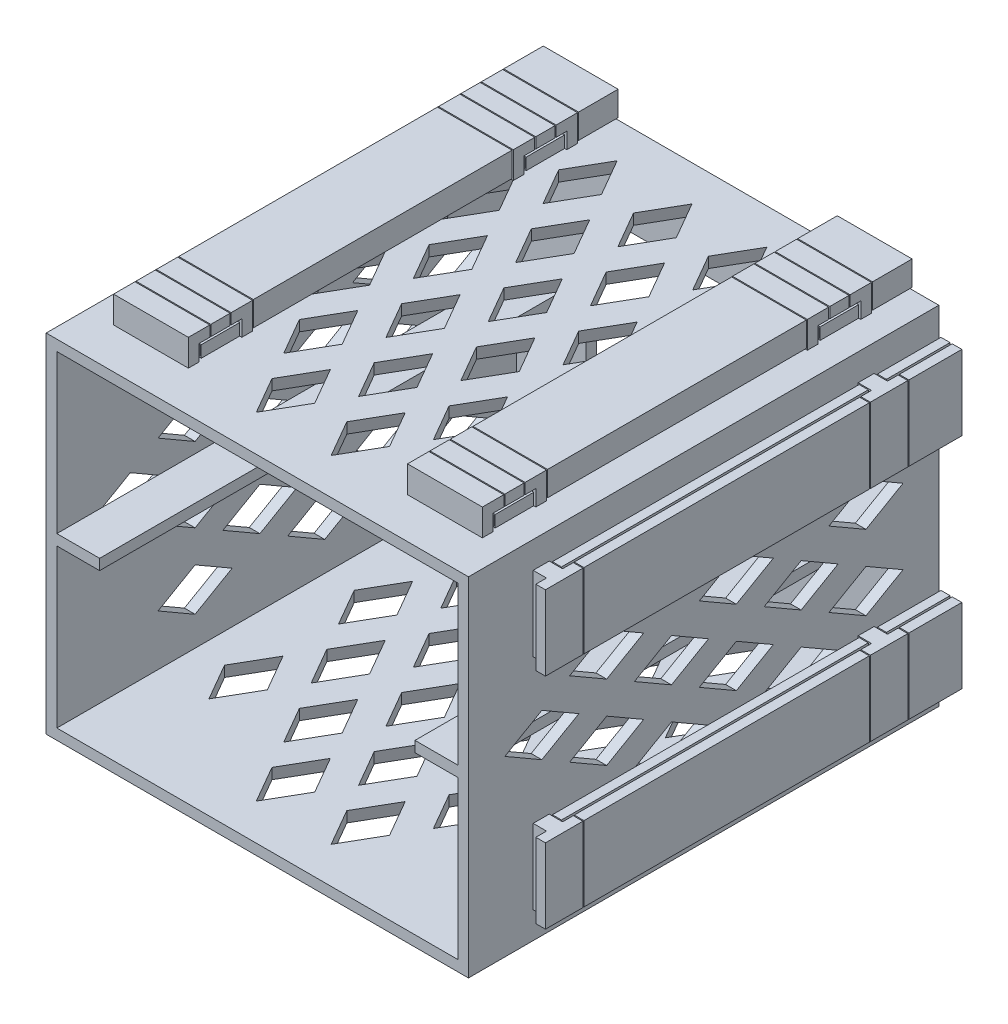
from build123d import *

# Parameters (mm, degrees)
CROQUIS1_W          = 79
CROQUIS1_H          = 65
CROQUIS1_W_2        = 49
CROQUIS1_H_2        = 35
FONDO_DEPTH         = 2
CROQUIS3_W          = 79
CROQUIS3_H          = 65
CROQUIS3_W_2        = 75
CROQUIS3_H_2        = 61
ESTRUCTURA_DEPTH    = 86
ROMBOSHOR_REACH     = 124.643
ROMBOSVERT_DEPTH    = 65
CROQUIS8_W          = 8
CROQUIS8_H          = 2
GUIAS_DEPTH         = 86
CROQUIS10_W         = 3
CROQUIS10_H         = 14
ANCDER01_DEPTH      = 2.5
CROQUIS11_W         = 7
CROQUIS11_H         = 14
ANCDER02_DEPTH      = 1.8
CROQUIS12_W         = 14
CROQUIS12_H         = 2
ANCSUP01_DEPTH      = 3
CROQUIS13_W         = 14
CROQUIS13_H         = 4
ANCSUP02_DEPTH      = 2
CROQUIS61_W         = 14
CROQUIS61_H         = 4.6
CROQUIS61_W_2       = 13.6
CROQUIS61_H_2       = 4.2
ESPANCSUP01_DEPTH   = 7.404
ESPANCSUP01_2_DEPTH = 7.404
CROQUIS57_W         = 13.954269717
CROQUIS57_H         = 4.6
CROQUIS57_W_2       = 13.554269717
CROQUIS57_H_2       = 4.2
ESPANCSUP02_DEPTH   = 48.392
ESPANCSUP02_2_DEPTH = 48.392
CROQUIS58_W         = 12.554269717
CROQUIS58_H         = 3.2
CROQUIS58_W_2       = 12.154269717
CROQUIS58_H_2       = 2.8
ESPANCSUP03_DEPTH   = 48.392
ESPANCSUP03_2_DEPTH = 48.392
CROQUIS59_W         = 11.154269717
CROQUIS59_H         = 1.8
CROQUIS59_W_2       = 10.754269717
CROQUIS59_H_2       = 1.4
ESPANCSUP04_DEPTH   = 48.392
ESPANCSUP04_2_DEPTH = 48.392
CROQUIS64_W         = 14
CROQUIS64_H         = 7.2
ESPANCSUP05_DEPTH   = 2.2
ESPANCSUP05_2_DEPTH = 2.2
ESPANCSUP05_3_DEPTH = 2.2
ESPANCSUP05_4_DEPTH = 2.2
CROQUIS66_W         = 13.6
CROQUIS66_H         = 1.8
ESPANCSUP06_DEPTH   = 7.2
CROQUIS68_W         = 13.6
CROQUIS68_H         = 1.8
ESPANCSUP07_DEPTH   = 7.2
CROQUIS70_W         = 14
CROQUIS70_H         = 3.6
ESPANCSUP08_DEPTH   = 2
ESPANCSUP08_2_DEPTH = 2
ESPANCSUP08_3_DEPTH = 2
ESPANCSUP08_4_DEPTH = 2
CROQUIS71_W         = 13.6
CROQUIS71_H         = 1.6
ESPANCSUP09_DEPTH   = 3.6
CROQUIS72_W         = 13.6
CROQUIS72_H         = 1.6
ESPANCSUP10_DEPTH   = 3.6
CROQUIS93_W         = 1.7
CROQUIS93_H         = 14
CROQUIS93_W_2       = 1.3
CROQUIS93_H_2       = 13.6
ESPANCDER01_DEPTH   = 11.904
ESPANCDER01_2_DEPTH = 11.904
CROQUIS94_W         = 1.8
CROQUIS94_H         = 14
CROQUIS94_W_2       = 1.4
CROQUIS94_H_2       = 13.6
ESPANCDER02_DEPTH   = 9.904
ESPANCDER02_2_DEPTH = 9.904
CROQUIS95_W         = 1.7
CROQUIS95_H         = 14
CROQUIS95_W_2       = 1.3
CROQUIS95_H_2       = 13.6
ESPANCDER03_DEPTH   = 57.392
ESPANCDER03_2_DEPTH = 57.392
CROQUIS96_W         = 0.5
CROQUIS96_H         = 12.8
ESPANCDER04_DEPTH   = 57.392
ESPANCDER04_2_DEPTH = 57.392
CROQUIS97_W         = 1.8
CROQUIS97_H         = 14
CROQUIS97_W_2       = 1.4
CROQUIS97_H_2       = 13.6
ESPANCDER05_DEPTH   = 53.392
ESPANCDER05_2_DEPTH = 53.392
CROQUIS98_W         = 0.6
CROQUIS98_H         = 12.8
ESPANCDER06_DEPTH   = 53.392
ESPANCDER06_2_DEPTH = 53.392


with BuildPart() as part:
    # Croquis1 → Fondo (new body)
    with BuildSketch(Plane(origin=(0, 0, 0), x_dir=(-1, 0, 0), z_dir=(0, 0, -1))):
        Rectangle(CROQUIS1_W, CROQUIS1_H)
        Rectangle(CROQUIS1_W_2, CROQUIS1_H_2, mode=Mode.SUBTRACT)
    extrude(amount=-FONDO_DEPTH)

    # Croquis3 → Estructura (add)
    with BuildSketch(Plane.XY.offset(2)):
        Rectangle(CROQUIS3_W, CROQUIS3_H)
        Rectangle(CROQUIS3_W_2, CROQUIS3_H_2, mode=Mode.SUBTRACT)
    extrude(amount=ESTRUCTURA_DEPTH)

    # RombosHor: up to this face of the body (flat: up to its plane)
    romboshor_end = Plane(part.part.faces().sort_by_distance((39.5, 0, 44))[0])
    # Croquis5 → RombosHor (cut, up to the picked face)
    with BuildSketch(Plane.ZY.offset(39.5), mode=Mode.PRIVATE) as romboshor_sk1:
        Polygon((13.628, 25), (20.556, 21), (13.628, 17), (6.7, 21), align=None)
    romboshor_tool1 = split(extrude(romboshor_sk1.sketch, amount=-ROMBOSHOR_REACH, mode=Mode.PRIVATE), bisect_by=romboshor_end, keep=Keep.BOTH, mode=Mode.PRIVATE)
    # Croquis5 → RombosHor (cut, up to the picked face)
    with BuildSketch(Plane.ZY.offset(39.5), mode=Mode.PRIVATE) as romboshor_sk2:
        Polygon((13.628, 11), (20.556, 7), (13.628, 3), (6.7, 7), align=None)
    romboshor_tool2 = split(extrude(romboshor_sk2.sketch, amount=-ROMBOSHOR_REACH, mode=Mode.PRIVATE), bisect_by=romboshor_end, keep=Keep.BOTH, mode=Mode.PRIVATE)
    # Croquis5 → RombosHor (cut, up to the picked face)
    with BuildSketch(Plane.ZY.offset(39.5), mode=Mode.PRIVATE) as romboshor_sk3:
        Polygon((13.628, -3), (20.556, -7), (13.628, -11), (6.7, -7), align=None)
    romboshor_tool3 = split(extrude(romboshor_sk3.sketch, amount=-ROMBOSHOR_REACH, mode=Mode.PRIVATE), bisect_by=romboshor_end, keep=Keep.BOTH, mode=Mode.PRIVATE)
    # Croquis5 → RombosHor (cut, up to the picked face)
    with BuildSketch(Plane.ZY.offset(39.5), mode=Mode.PRIVATE) as romboshor_sk4:
        Polygon((13.628, -17), (20.556, -21), (13.628, -25), (6.7, -21), align=None)
    romboshor_tool4 = split(extrude(romboshor_sk4.sketch, amount=-ROMBOSHOR_REACH, mode=Mode.PRIVATE), bisect_by=romboshor_end, keep=Keep.BOTH, mode=Mode.PRIVATE)
    # Croquis5 → RombosHor (cut, up to the picked face)
    with BuildSketch(Plane.ZY.offset(39.5), mode=Mode.PRIVATE) as romboshor_sk5:
        Polygon((37.884, 25), (44.812, 21), (37.884, 17), (30.956, 21), align=None)
    romboshor_tool5 = split(extrude(romboshor_sk5.sketch, amount=-ROMBOSHOR_REACH, mode=Mode.PRIVATE), bisect_by=romboshor_end, keep=Keep.BOTH, mode=Mode.PRIVATE)
    # Croquis5 → RombosHor (cut, up to the picked face)
    with BuildSketch(Plane.ZY.offset(39.5), mode=Mode.PRIVATE) as romboshor_sk6:
        Polygon((44.812, 7), (37.884, 3), (30.956, 7), (37.884, 11), align=None)
    romboshor_tool6 = split(extrude(romboshor_sk6.sketch, amount=-ROMBOSHOR_REACH, mode=Mode.PRIVATE), bisect_by=romboshor_end, keep=Keep.BOTH, mode=Mode.PRIVATE)
    # Croquis5 → RombosHor (cut, up to the picked face)
    with BuildSketch(Plane.ZY.offset(39.5), mode=Mode.PRIVATE) as romboshor_sk7:
        Polygon((44.812, -7), (37.884, -11), (30.956, -7), (37.884, -3), align=None)
    romboshor_tool7 = split(extrude(romboshor_sk7.sketch, amount=-ROMBOSHOR_REACH, mode=Mode.PRIVATE), bisect_by=romboshor_end, keep=Keep.BOTH, mode=Mode.PRIVATE)
    # Croquis5 → RombosHor (cut, up to the picked face)
    with BuildSketch(Plane.ZY.offset(39.5), mode=Mode.PRIVATE) as romboshor_sk8:
        Polygon((37.884, -17), (44.812, -21), (37.884, -25), (30.956, -21), align=None)
    romboshor_tool8 = split(extrude(romboshor_sk8.sketch, amount=-ROMBOSHOR_REACH, mode=Mode.PRIVATE), bisect_by=romboshor_end, keep=Keep.BOTH, mode=Mode.PRIVATE)
    # Croquis5 → RombosHor (cut, up to the picked face)
    with BuildSketch(Plane.ZY.offset(39.5), mode=Mode.PRIVATE) as romboshor_sk9:
        Polygon((62.14, 25), (69.068, 21), (62.14, 17), (55.212, 21), align=None)
    romboshor_tool9 = split(extrude(romboshor_sk9.sketch, amount=-ROMBOSHOR_REACH, mode=Mode.PRIVATE), bisect_by=romboshor_end, keep=Keep.BOTH, mode=Mode.PRIVATE)
    # Croquis5 → RombosHor (cut, up to the picked face)
    with BuildSketch(Plane.ZY.offset(39.5), mode=Mode.PRIVATE) as romboshor_sk10:
        Polygon((69.068, 7), (62.14, 3), (55.212, 7), (62.14, 11), align=None)
    romboshor_tool10 = split(extrude(romboshor_sk10.sketch, amount=-ROMBOSHOR_REACH, mode=Mode.PRIVATE), bisect_by=romboshor_end, keep=Keep.BOTH, mode=Mode.PRIVATE)
    # Croquis5 → RombosHor (cut, up to the picked face)
    with BuildSketch(Plane.ZY.offset(39.5), mode=Mode.PRIVATE) as romboshor_sk11:
        Polygon((69.068, -7), (62.14, -11), (55.212, -7), (62.14, -3), align=None)
    romboshor_tool11 = split(extrude(romboshor_sk11.sketch, amount=-ROMBOSHOR_REACH, mode=Mode.PRIVATE), bisect_by=romboshor_end, keep=Keep.BOTH, mode=Mode.PRIVATE)
    # Croquis5 → RombosHor (cut, up to the picked face)
    with BuildSketch(Plane.ZY.offset(39.5), mode=Mode.PRIVATE) as romboshor_sk12:
        Polygon((62.14, -17), (69.068, -21), (62.14, -25), (55.212, -21), align=None)
    romboshor_tool12 = split(extrude(romboshor_sk12.sketch, amount=-ROMBOSHOR_REACH, mode=Mode.PRIVATE), bisect_by=romboshor_end, keep=Keep.BOTH, mode=Mode.PRIVATE)
    # Croquis5 → RombosHor (cut, up to the picked face)
    with BuildSketch(Plane.ZY.offset(39.5), mode=Mode.PRIVATE) as romboshor_sk13:
        Polygon((50.012, 18), (56.94, 14), (50.012, 10), (43.084, 14), align=None)
    romboshor_tool13 = split(extrude(romboshor_sk13.sketch, amount=-ROMBOSHOR_REACH, mode=Mode.PRIVATE), bisect_by=romboshor_end, keep=Keep.BOTH, mode=Mode.PRIVATE)
    # Croquis5 → RombosHor (cut, up to the picked face)
    with BuildSketch(Plane.ZY.offset(39.5), mode=Mode.PRIVATE) as romboshor_sk14:
        Polygon((50.012, 4), (56.94, 0), (50.012, -4), (43.084, 0), align=None)
    romboshor_tool14 = split(extrude(romboshor_sk14.sketch, amount=-ROMBOSHOR_REACH, mode=Mode.PRIVATE), bisect_by=romboshor_end, keep=Keep.BOTH, mode=Mode.PRIVATE)
    # Croquis5 → RombosHor (cut, up to the picked face)
    with BuildSketch(Plane.ZY.offset(39.5), mode=Mode.PRIVATE) as romboshor_sk15:
        Polygon((56.94, -14), (50.012, -18), (43.084, -14), (50.012, -10), align=None)
    romboshor_tool15 = split(extrude(romboshor_sk15.sketch, amount=-ROMBOSHOR_REACH, mode=Mode.PRIVATE), bisect_by=romboshor_end, keep=Keep.BOTH, mode=Mode.PRIVATE)
    # Croquis5 → RombosHor (cut, up to the picked face)
    with BuildSketch(Plane.ZY.offset(39.5), mode=Mode.PRIVATE) as romboshor_sk16:
        Polygon((18.828, 14), (25.756, 18), (32.684, 14), (25.756, 10), align=None)
    romboshor_tool16 = split(extrude(romboshor_sk16.sketch, amount=-ROMBOSHOR_REACH, mode=Mode.PRIVATE), bisect_by=romboshor_end, keep=Keep.BOTH, mode=Mode.PRIVATE)
    # Croquis5 → RombosHor (cut, up to the picked face)
    with BuildSketch(Plane.ZY.offset(39.5), mode=Mode.PRIVATE) as romboshor_sk17:
        Polygon((25.756, 4), (32.684, 0), (25.756, -4), (18.828, 0), align=None)
    romboshor_tool17 = split(extrude(romboshor_sk17.sketch, amount=-ROMBOSHOR_REACH, mode=Mode.PRIVATE), bisect_by=romboshor_end, keep=Keep.BOTH, mode=Mode.PRIVATE)
    # Croquis5 → RombosHor (cut, up to the picked face)
    with BuildSketch(Plane.ZY.offset(39.5), mode=Mode.PRIVATE) as romboshor_sk18:
        Polygon((25.756, -18), (18.828, -14), (25.756, -10), (32.684, -14), align=None)
    romboshor_tool18 = split(extrude(romboshor_sk18.sketch, amount=-ROMBOSHOR_REACH, mode=Mode.PRIVATE), bisect_by=romboshor_end, keep=Keep.BOTH, mode=Mode.PRIVATE)
    # Croquis5 → RombosHor (cut, up to the picked face)
    with BuildSketch(Plane.ZY.offset(39.5), mode=Mode.PRIVATE) as romboshor_sk19:
        Polygon((81.196, 0), (74.268, -4), (67.34, 0), (74.268, 4), align=None)
    romboshor_tool19 = split(extrude(romboshor_sk19.sketch, amount=-ROMBOSHOR_REACH, mode=Mode.PRIVATE), bisect_by=romboshor_end, keep=Keep.BOTH, mode=Mode.PRIVATE)
    add(romboshor_tool1.solids().sort_by(Axis((-39.5, 21, 13.628), (1, 0, 0)))[0], mode=Mode.SUBTRACT)
    add(romboshor_tool2.solids().sort_by(Axis((-39.5, 7, 13.628), (1, 0, 0)))[0], mode=Mode.SUBTRACT)
    add(romboshor_tool3.solids().sort_by(Axis((-39.5, -7, 13.628), (1, 0, 0)))[0], mode=Mode.SUBTRACT)
    add(romboshor_tool4.solids().sort_by(Axis((-39.5, -21, 13.628), (1, 0, 0)))[0], mode=Mode.SUBTRACT)
    add(romboshor_tool5.solids().sort_by(Axis((-39.5, 21, 37.884), (1, 0, 0)))[0], mode=Mode.SUBTRACT)
    add(romboshor_tool6.solids().sort_by(Axis((-39.5, 7, 37.884), (1, 0, 0)))[0], mode=Mode.SUBTRACT)
    add(romboshor_tool7.solids().sort_by(Axis((-39.5, -7, 37.884), (1, 0, 0)))[0], mode=Mode.SUBTRACT)
    add(romboshor_tool8.solids().sort_by(Axis((-39.5, -21, 37.884), (1, 0, 0)))[0], mode=Mode.SUBTRACT)
    add(romboshor_tool9.solids().sort_by(Axis((-39.5, 21, 62.14), (1, 0, 0)))[0], mode=Mode.SUBTRACT)
    add(romboshor_tool10.solids().sort_by(Axis((-39.5, 7, 62.14), (1, 0, 0)))[0], mode=Mode.SUBTRACT)
    add(romboshor_tool11.solids().sort_by(Axis((-39.5, -7, 62.14), (1, 0, 0)))[0], mode=Mode.SUBTRACT)
    add(romboshor_tool12.solids().sort_by(Axis((-39.5, -21, 62.14), (1, 0, 0)))[0], mode=Mode.SUBTRACT)
    add(romboshor_tool13.solids().sort_by(Axis((-39.5, 14, 50.012), (1, 0, 0)))[0], mode=Mode.SUBTRACT)
    add(romboshor_tool14.solids().sort_by(Axis((-39.5, 0, 50.012), (1, 0, 0)))[0], mode=Mode.SUBTRACT)
    add(romboshor_tool15.solids().sort_by(Axis((-39.5, -14, 50.012), (1, 0, 0)))[0], mode=Mode.SUBTRACT)
    add(romboshor_tool16.solids().sort_by(Axis((-39.5, 14, 25.756), (1, 0, 0)))[0], mode=Mode.SUBTRACT)
    add(romboshor_tool17.solids().sort_by(Axis((-39.5, 0, 25.756), (1, 0, 0)))[0], mode=Mode.SUBTRACT)
    add(romboshor_tool18.solids().sort_by(Axis((-39.5, -14, 25.756), (1, 0, 0)))[0], mode=Mode.SUBTRACT)
    add(romboshor_tool19.solids().sort_by(Axis((-39.5, 0, 74.268), (1, 0, 0)))[0], mode=Mode.SUBTRACT)

    # Croquis9 → RombosVert (cut)
    with BuildSketch(Plane(origin=(0, 32.5, 0), x_dir=(1, 0, 0), z_dir=(0, 1, 0))):
        Polygon((28, -6.68718177), (24, -13.615385), (28, -20.543588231), (32, -13.615385), align=None)
        Polygon((14, -6.68718177), (10, -13.615385), (14, -20.543588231), (18, -13.615385), align=None)
        Polygon((0, -6.68718177), (-4, -13.615385), (0, -20.543588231), (4, -13.615385), align=None)
        Polygon((-14, -6.68718177), (-18, -13.615385), (-14, -20.543588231), (-10, -13.615385), align=None)
        Polygon((-28, -6.68718177), (-32, -13.615385), (-28, -20.543588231), (-24, -13.615385), align=None)
        Polygon((14, -30.94359177), (10, -37.871795), (14, -44.799998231), (18, -37.871795), align=None)
        Polygon((0, -30.94359177), (-4, -37.871795), (0, -44.799998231), (4, -37.871795), align=None)
        Polygon((-14, -30.94359177), (-18, -37.871795), (-14, -44.799998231), (-10, -37.871795), align=None)
        Polygon((-28, -30.94359177), (-32, -37.871795), (-28, -44.799998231), (-24, -37.871795), align=None)
        Polygon((14, -55.20000177), (10, -62.128205), (14, -69.056408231), (18, -62.128205), align=None)
        Polygon((0, -55.20000177), (-4, -62.128205), (0, -69.056408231), (4, -62.128205), align=None)
        Polygon((-14, -55.20000177), (-18, -62.128205), (-14, -69.056408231), (-10, -62.128205), align=None)
        Polygon((-28, -55.20000177), (-32, -62.128205), (-28, -69.056408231), (-24, -62.128205), align=None)
        Polygon((28, -30.94359177), (24, -37.871795), (28, -44.799998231), (32, -37.871795), align=None)
        Polygon((28, -55.20000177), (24, -62.128205), (28, -69.056408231), (32, -62.128205), align=None)
        Polygon((17, -50.001795), (21, -56.929998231), (25, -50.001795), (21, -43.07359177), align=None)
        Polygon((7, -67.33000177), (11, -74.258205), (7, -81.186408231), (3, -74.258205), align=None)
        Polygon((-7, -67.33000177), (-11, -74.258205), (-7, -81.186408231), (-3, -74.258205), align=None)
        Polygon((7, -18.81718177), (3, -25.745385), (7, -32.673588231), (11, -25.745385), align=None)
        Polygon((17, -25.745385), (21, -32.673588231), (25, -25.745385), (21, -18.81718177), align=None)
        Polygon((-7, -43.07359177), (-11, -50.001795), (-7, -56.929998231), (-3, -50.001795), align=None)
        Polygon((-21, -43.07359177), (-25, -50.001795), (-21, -56.929998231), (-17, -50.001795), align=None)
        Polygon((-3, -25.745385), (-7, -32.673588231), (-11, -25.745385), (-7, -18.81718177), align=None)
        Polygon((-21, -18.81718177), (-17, -25.745385), (-21, -32.673588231), (-25, -25.745385), align=None)
        Polygon((7, -43.07359177), (3, -50.001795), (7, -56.929998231), (11, -50.001795), align=None)
    extrude(amount=-ROMBOSVERT_DEPTH, mode=Mode.SUBTRACT)

    # Croquis8 → Guias (add)
    with BuildSketch(Plane.XY.offset(2)):
        with Locations((-33.5, 0)):
            Rectangle(CROQUIS8_W, CROQUIS8_H)
        with Locations((33.5, 0)):
            Rectangle(CROQUIS8_W, CROQUIS8_H)
    extrude(amount=GUIAS_DEPTH)

    # Croquis10 → AncDer01 (add)
    with BuildSketch(Plane(origin=(39.5, 0, 0), x_dir=(0, 0, -1), z_dir=(1, 0, 0))):
        with Locations((-13.604, -20.5)):
            Rectangle(CROQUIS10_W, CROQUIS10_H)
        with Locations((-74.396, 20.5)):
            Rectangle(CROQUIS10_W, CROQUIS10_H)
        with Locations((-13.604, 20.5)):
            Rectangle(CROQUIS10_W, CROQUIS10_H)
        with Locations((-74.396, -20.5)):
            Rectangle(CROQUIS10_W, CROQUIS10_H)
    extrude(amount=ANCDER01_DEPTH)

    # Croquis11 → AncDer02 (add)
    with BuildSketch(Plane(origin=(42, 0, 0), x_dir=(0, 0, -1), z_dir=(1, 0, 0))):
        with Locations((-13.604, 20.5)):
            Rectangle(CROQUIS11_W, CROQUIS11_H)
        with Locations((-13.604, -20.5)):
            Rectangle(CROQUIS11_W, CROQUIS11_H)
        with Locations((-74.396, -20.5)):
            Rectangle(CROQUIS11_W, CROQUIS11_H)
        with Locations((-74.396, 20.5)):
            Rectangle(CROQUIS11_W, CROQUIS11_H)
    extrude(amount=ANCDER02_DEPTH)

    # Croquis12 → AncSup01 (add)
    with BuildSketch(Plane(origin=(0, 32.5, 0), x_dir=(1, 0, 0), z_dir=(0, 1, 0))):
        with Locations((27.5, -8.604)):
            Rectangle(CROQUIS12_W, CROQUIS12_H)
        with Locations((27.5, -18.604)):
            Rectangle(CROQUIS12_W, CROQUIS12_H)
        with Locations((-27.5, -79.396)):
            Rectangle(CROQUIS12_W, CROQUIS12_H)
        with Locations((-27.5, -69.396)):
            Rectangle(CROQUIS12_W, CROQUIS12_H)
        with Locations((27.5, -69.396)):
            Rectangle(CROQUIS12_W, CROQUIS12_H)
        with Locations((-27.5, -18.604)):
            Rectangle(CROQUIS12_W, CROQUIS12_H)
        with Locations((-27.5, -8.604)):
            Rectangle(CROQUIS12_W, CROQUIS12_H)
        with Locations((27.5, -79.396)):
            Rectangle(CROQUIS12_W, CROQUIS12_H)
    extrude(amount=ANCSUP01_DEPTH)

    # Croquis13 → AncSup02 (add)
    with BuildSketch(Plane(origin=(0, 35.5, 0), x_dir=(1, 0, 0), z_dir=(0, 1, 0))):
        with Locations((-27.5, -9.604)):
            Rectangle(CROQUIS13_W, CROQUIS13_H)
        with Locations((-27.5, -17.604)):
            Rectangle(CROQUIS13_W, CROQUIS13_H)
        with Locations((27.5, -17.604)):
            Rectangle(CROQUIS13_W, CROQUIS13_H)
        with Locations((27.5, -9.604)):
            Rectangle(CROQUIS13_W, CROQUIS13_H)
        with Locations((27.5, -78.396)):
            Rectangle(CROQUIS13_W, CROQUIS13_H)
        with Locations((27.5, -70.396)):
            Rectangle(CROQUIS13_W, CROQUIS13_H)
        with Locations((-27.5, -70.396)):
            Rectangle(CROQUIS13_W, CROQUIS13_H)
        with Locations((-27.5, -78.396)):
            Rectangle(CROQUIS13_W, CROQUIS13_H)
    extrude(amount=ANCSUP02_DEPTH)


with BuildPart() as body_2:
    # Croquis61 → EspAncSup01 (new body)
    with BuildSketch(Plane(origin=(0, 0, 0), x_dir=(-1, 0, 0), z_dir=(0, 0, -1))):
        with Locations((27.5, 35.2)):
            Rectangle(CROQUIS61_W, CROQUIS61_H)
        with Locations((27.5, 35.2)):
            Rectangle(CROQUIS61_W_2, CROQUIS61_H_2, mode=Mode.SUBTRACT)
    extrude(amount=-ESPANCSUP01_DEPTH)


with BuildPart() as body_3:
    # Croquis61 → EspAncSup01 2 (new body)
    with BuildSketch(Plane(origin=(0, 0, 0), x_dir=(-1, 0, 0), z_dir=(0, 0, -1))):
        with Locations((-27.5, 35.2)):
            Rectangle(CROQUIS61_W, CROQUIS61_H)
        with Locations((-27.5, 35.2)):
            Rectangle(CROQUIS61_W_2, CROQUIS61_H_2, mode=Mode.SUBTRACT)
    extrude(amount=-ESPANCSUP01_2_DEPTH)


with BuildPart() as body_4:
    # Croquis57 → EspAncSup02 (new body)
    with BuildSketch(Plane.XY.offset(19.804)):
        with Locations((27.522865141, 35.2)):
            Rectangle(CROQUIS57_W, CROQUIS57_H)
        with Locations((27.522865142, 35.2)):
            Rectangle(CROQUIS57_W_2, CROQUIS57_H_2, mode=Mode.SUBTRACT)
    extrude(amount=ESPANCSUP02_DEPTH)


with BuildPart() as body_5:
    # Croquis57 → EspAncSup02 2 (new body)
    with BuildSketch(Plane.XY.offset(19.804)):
        with Locations((-27.522865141, 35.2)):
            Rectangle(CROQUIS57_W, CROQUIS57_H)
        with Locations((-27.522865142, 35.2)):
            Rectangle(CROQUIS57_W_2, CROQUIS57_H_2, mode=Mode.SUBTRACT)
    extrude(amount=ESPANCSUP02_2_DEPTH)


with BuildPart() as body_6:
    # Croquis58 → EspAncSup03 (new body)
    with BuildSketch(Plane.XY.offset(19.804)):
        with Locations((27.522865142, 35.2)):
            Rectangle(CROQUIS58_W, CROQUIS58_H)
        with Locations((27.522865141, 35.2)):
            Rectangle(CROQUIS58_W_2, CROQUIS58_H_2, mode=Mode.SUBTRACT)
    extrude(amount=ESPANCSUP03_DEPTH)


with BuildPart() as body_7:
    # Croquis58 → EspAncSup03 2 (new body)
    with BuildSketch(Plane.XY.offset(19.804)):
        with Locations((-27.522865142, 35.2)):
            Rectangle(CROQUIS58_W, CROQUIS58_H)
        with Locations((-27.522865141, 35.2)):
            Rectangle(CROQUIS58_W_2, CROQUIS58_H_2, mode=Mode.SUBTRACT)
    extrude(amount=ESPANCSUP03_2_DEPTH)


with BuildPart() as body_8:
    # Croquis59 → EspAncSup04 (new body)
    with BuildSketch(Plane.XY.offset(19.804)):
        with Locations((27.522865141, 35.2)):
            Rectangle(CROQUIS59_W, CROQUIS59_H)
        with Locations((27.522865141, 35.2)):
            Rectangle(CROQUIS59_W_2, CROQUIS59_H_2, mode=Mode.SUBTRACT)
    extrude(amount=ESPANCSUP04_DEPTH)


with BuildPart() as body_9:
    # Croquis59 → EspAncSup04 2 (new body)
    with BuildSketch(Plane.XY.offset(19.804)):
        with Locations((-27.522865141, 35.2)):
            Rectangle(CROQUIS59_W, CROQUIS59_H)
        with Locations((-27.522865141, 35.2)):
            Rectangle(CROQUIS59_W_2, CROQUIS59_H_2, mode=Mode.SUBTRACT)
    extrude(amount=ESPANCSUP04_2_DEPTH)


with BuildPart() as body_10:
    # Croquis64 → EspAncSup05 (new body)
    with BuildSketch(Plane(origin=(0, 32.9, 0), x_dir=(1, 0, 0), z_dir=(0, 1, 0))):
        with Locations((-27.5, -13.604)):
            Rectangle(CROQUIS64_W, CROQUIS64_H)
    extrude(amount=ESPANCSUP05_DEPTH)


with BuildPart() as body_11:
    # Croquis64 → EspAncSup05 2 (new body)
    with BuildSketch(Plane(origin=(0, 32.9, 0), x_dir=(1, 0, 0), z_dir=(0, 1, 0))):
        with Locations((27.5, -13.604)):
            Rectangle(CROQUIS64_W, CROQUIS64_H)
    extrude(amount=ESPANCSUP05_2_DEPTH)


with BuildPart() as body_12:
    # Croquis64 → EspAncSup05 3 (new body)
    with BuildSketch(Plane(origin=(0, 32.9, 0), x_dir=(1, 0, 0), z_dir=(0, 1, 0))):
        with Locations((27.5, -74.396)):
            Rectangle(CROQUIS64_W, CROQUIS64_H)
    extrude(amount=ESPANCSUP05_3_DEPTH)


with BuildPart() as body_13:
    # Croquis64 → EspAncSup05 4 (new body)
    with BuildSketch(Plane(origin=(0, 32.9, 0), x_dir=(1, 0, 0), z_dir=(0, 1, 0))):
        with Locations((-27.5, -74.396)):
            Rectangle(CROQUIS64_W, CROQUIS64_H)
    extrude(amount=ESPANCSUP05_4_DEPTH)


with BuildPart() as espancsup06_tool:
    # Croquis66 → EspAncSup06 (new body)
    with BuildSketch(Plane.XY.offset(17.204)):
        with Locations((-27.5, 34)):
            Rectangle(CROQUIS66_W, CROQUIS66_H)
        with Locations((27.5, 34)):
            Rectangle(CROQUIS66_W, CROQUIS66_H)
    extrude(amount=-ESPANCSUP06_DEPTH)


with BuildPart() as body_10_1:
    add(body_10.part)

    # EspAncSup06: cut by espancsup06_tool
    add(espancsup06_tool.part, mode=Mode.SUBTRACT)


with BuildPart() as body_11_1:
    add(body_11.part)

    # EspAncSup06: cut by espancsup06_tool
    add(espancsup06_tool.part, mode=Mode.SUBTRACT)


with BuildPart() as espancsup07_tool:
    # Croquis68 → EspAncSup07 (new body)
    with BuildSketch(Plane.XY.offset(77.996)):
        with Locations((27.5, 34)):
            Rectangle(CROQUIS68_W, CROQUIS68_H)
        with Locations((-27.5, 34)):
            Rectangle(CROQUIS68_W, CROQUIS68_H)
    extrude(amount=-ESPANCSUP07_DEPTH)


with BuildPart() as body_12_1:
    add(body_12.part)

    # EspAncSup07: cut by espancsup07_tool
    add(espancsup07_tool.part, mode=Mode.SUBTRACT)


with BuildPart() as body_13_1:
    add(body_13.part)

    # EspAncSup07: cut by espancsup07_tool
    add(espancsup07_tool.part, mode=Mode.SUBTRACT)


with BuildPart() as body_14:
    # Croquis70 → EspAncSup08 (new body)
    with BuildSketch(Plane.XZ.offset(-35.5)):
        with Locations((-27.5, 74.396)):
            Rectangle(CROQUIS70_W, CROQUIS70_H)
    extrude(amount=-ESPANCSUP08_DEPTH)


with BuildPart() as body_15:
    # Croquis70 → EspAncSup08 2 (new body)
    with BuildSketch(Plane.XZ.offset(-35.5)):
        with Locations((27.5, 13.604)):
            Rectangle(CROQUIS70_W, CROQUIS70_H)
    extrude(amount=-ESPANCSUP08_2_DEPTH)


with BuildPart() as body_16:
    # Croquis70 → EspAncSup08 3 (new body)
    with BuildSketch(Plane.XZ.offset(-35.5)):
        with Locations((27.5, 74.396)):
            Rectangle(CROQUIS70_W, CROQUIS70_H)
    extrude(amount=-ESPANCSUP08_3_DEPTH)


with BuildPart() as body_17:
    # Croquis70 → EspAncSup08 4 (new body)
    with BuildSketch(Plane.XZ.offset(-35.5)):
        with Locations((-27.5, 13.604)):
            Rectangle(CROQUIS70_W, CROQUIS70_H)
    extrude(amount=-ESPANCSUP08_4_DEPTH)


with BuildPart() as espancsup09_tool:
    # Croquis71 → EspAncSup09 (new body)
    with BuildSketch(Plane(origin=(0, 0, 72.596), x_dir=(-1, 0, 0), z_dir=(0, 0, -1))):
        with Locations((-27.5, 36.5)):
            Rectangle(CROQUIS71_W, CROQUIS71_H)
        with Locations((27.5, 36.5)):
            Rectangle(CROQUIS71_W, CROQUIS71_H)
    extrude(amount=-ESPANCSUP09_DEPTH)


with BuildPart() as body_14_1:
    add(body_14.part)

    # EspAncSup09: cut by espancsup09_tool
    add(espancsup09_tool.part, mode=Mode.SUBTRACT)


with BuildPart() as body_16_1:
    add(body_16.part)

    # EspAncSup09: cut by espancsup09_tool
    add(espancsup09_tool.part, mode=Mode.SUBTRACT)


with BuildPart() as espancsup10_tool:
    # Croquis72 → EspAncSup10 (new body)
    with BuildSketch(Plane(origin=(0, 0, 11.804), x_dir=(-1, 0, 0), z_dir=(0, 0, -1))):
        with Locations((-27.5, 36.5)):
            Rectangle(CROQUIS72_W, CROQUIS72_H)
        with Locations((27.5, 36.5)):
            Rectangle(CROQUIS72_W, CROQUIS72_H)
    extrude(amount=-ESPANCSUP10_DEPTH)


with BuildPart() as body_15_1:
    add(body_15.part)

    # EspAncSup10: cut by espancsup10_tool
    add(espancsup10_tool.part, mode=Mode.SUBTRACT)


with BuildPart() as body_17_1:
    add(body_17.part)

    # EspAncSup10: cut by espancsup10_tool
    add(espancsup10_tool.part, mode=Mode.SUBTRACT)


with BuildPart() as body_18:
    # Croquis93 → EspAncDer01 (new body)
    with BuildSketch(Plane(origin=(0, 0, 0), x_dir=(-1, 0, 0), z_dir=(0, 0, -1))):
        with Locations((-40.75, -20.5)):
            Rectangle(CROQUIS93_W, CROQUIS93_H)
        with Locations((-40.75, -20.5)):
            Rectangle(CROQUIS93_W_2, CROQUIS93_H_2, mode=Mode.SUBTRACT)
    extrude(amount=-ESPANCDER01_DEPTH)


with BuildPart() as body_19:
    # Croquis93 → EspAncDer01 2 (new body)
    with BuildSketch(Plane(origin=(0, 0, 0), x_dir=(-1, 0, 0), z_dir=(0, 0, -1))):
        with Locations((-40.75, 20.5)):
            Rectangle(CROQUIS93_W, CROQUIS93_H)
        with Locations((-40.75, 20.5)):
            Rectangle(CROQUIS93_W_2, CROQUIS93_H_2, mode=Mode.SUBTRACT)
    extrude(amount=-ESPANCDER01_2_DEPTH)


with BuildPart() as body_20:
    # Croquis94 → EspAncDer02 (new body)
    with BuildSketch(Plane(origin=(0, 0, 0), x_dir=(-1, 0, 0), z_dir=(0, 0, -1))):
        with Locations((-42.9, -20.5)):
            Rectangle(CROQUIS94_W, CROQUIS94_H)
        with Locations((-42.9, -20.5)):
            Rectangle(CROQUIS94_W_2, CROQUIS94_H_2, mode=Mode.SUBTRACT)
    extrude(amount=-ESPANCDER02_DEPTH)


with BuildPart() as body_21:
    # Croquis94 → EspAncDer02 2 (new body)
    with BuildSketch(Plane(origin=(0, 0, 0), x_dir=(-1, 0, 0), z_dir=(0, 0, -1))):
        with Locations((-42.9, 20.5)):
            Rectangle(CROQUIS94_W, CROQUIS94_H)
        with Locations((-42.9, 20.5)):
            Rectangle(CROQUIS94_W_2, CROQUIS94_H_2, mode=Mode.SUBTRACT)
    extrude(amount=-ESPANCDER02_2_DEPTH)


with BuildPart() as body_22:
    # Croquis95 → EspAncDer03 (new body)
    with BuildSketch(Plane.XY.offset(15.304)):
        with Locations((40.75, -20.5)):
            Rectangle(CROQUIS95_W, CROQUIS95_H)
        with Locations((40.75, -20.5)):
            Rectangle(CROQUIS95_W_2, CROQUIS95_H_2, mode=Mode.SUBTRACT)
    extrude(amount=ESPANCDER03_DEPTH)


with BuildPart() as body_23:
    # Croquis95 → EspAncDer03 2 (new body)
    with BuildSketch(Plane.XY.offset(15.304)):
        with Locations((40.75, 20.5)):
            Rectangle(CROQUIS95_W, CROQUIS95_H)
        with Locations((40.75, 20.5)):
            Rectangle(CROQUIS95_W_2, CROQUIS95_H_2, mode=Mode.SUBTRACT)
    extrude(amount=ESPANCDER03_2_DEPTH)


with BuildPart() as body_24:
    # Croquis96 → EspAncDer04 (new body)
    with BuildSketch(Plane.XY.offset(15.304)):
        with Locations((40.75, -20.5)):
            Rectangle(CROQUIS96_W, CROQUIS96_H)
    extrude(amount=ESPANCDER04_DEPTH)


with BuildPart() as body_25:
    # Croquis96 → EspAncDer04 2 (new body)
    with BuildSketch(Plane.XY.offset(15.304)):
        with Locations((40.75, 20.5)):
            Rectangle(CROQUIS96_W, CROQUIS96_H)
    extrude(amount=ESPANCDER04_2_DEPTH)


with BuildPart() as body_26:
    # Croquis97 → EspAncDer05 (new body)
    with BuildSketch(Plane.XY.offset(17.304)):
        with Locations((42.9, 20.5)):
            Rectangle(CROQUIS97_W, CROQUIS97_H)
        with Locations((42.9, 20.5)):
            Rectangle(CROQUIS97_W_2, CROQUIS97_H_2, mode=Mode.SUBTRACT)
    extrude(amount=ESPANCDER05_DEPTH)


with BuildPart() as body_27:
    # Croquis97 → EspAncDer05 2 (new body)
    with BuildSketch(Plane.XY.offset(17.304)):
        with Locations((42.9, -20.5)):
            Rectangle(CROQUIS97_W, CROQUIS97_H)
        with Locations((42.9, -20.5)):
            Rectangle(CROQUIS97_W_2, CROQUIS97_H_2, mode=Mode.SUBTRACT)
    extrude(amount=ESPANCDER05_2_DEPTH)


with BuildPart() as body_28:
    # Croquis98 → EspAncDer06 (new body)
    with BuildSketch(Plane.XY.offset(17.304)):
        with Locations((42.9, 20.5)):
            Rectangle(CROQUIS98_W, CROQUIS98_H)
    extrude(amount=ESPANCDER06_DEPTH)


with BuildPart() as body_29:
    # Croquis98 → EspAncDer06 2 (new body)
    with BuildSketch(Plane.XY.offset(17.304)):
        with Locations((42.9, -20.5)):
            Rectangle(CROQUIS98_W, CROQUIS98_H)
    extrude(amount=ESPANCDER06_2_DEPTH)


solid = Compound([part.part, body_2.part, body_3.part, body_4.part, body_5.part, body_6.part, body_7.part, body_8.part, body_9.part, body_10_1.part, body_11_1.part, body_12_1.part, body_13_1.part, body_14_1.part, body_16_1.part, body_15_1.part, body_17_1.part, body_18.part, body_19.part, body_20.part, body_21.part, body_22.part, body_23.part, body_24.part, body_25.part, body_26.part, body_27.part, body_28.part, body_29.part])
